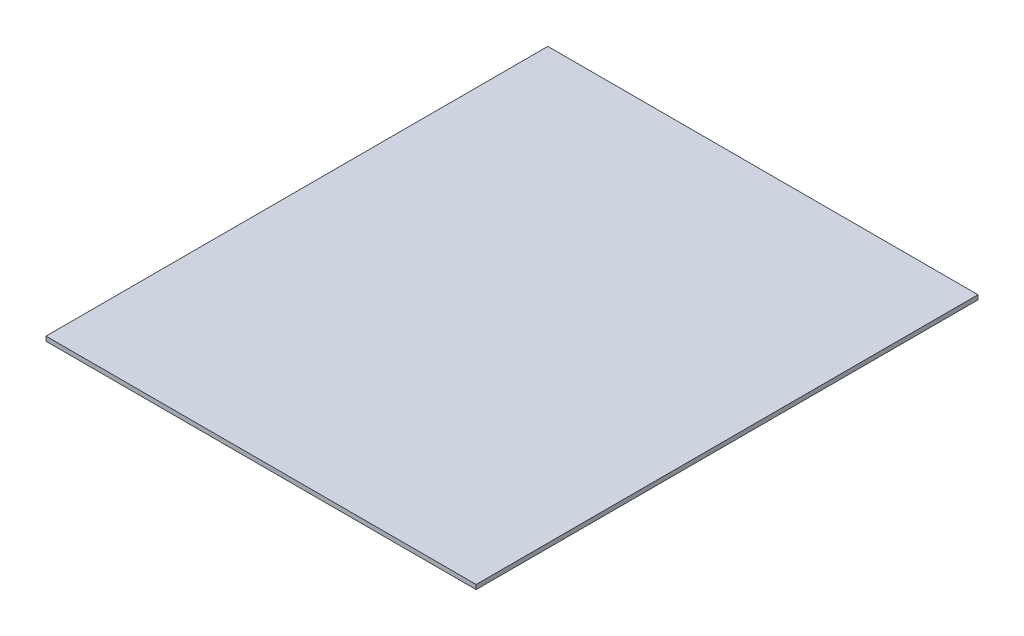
from build123d import *

# Parameters (mm, degrees)
SKETCH1_W           = 609.6
SKETCH1_H           = 711.2
BOSS_EXTRUDE1_DEPTH = 6.35


with BuildPart() as part:
    # Sketch1 → Boss-Extrude1 (new body)
    with BuildSketch(Plane(origin=(0, 0, 0), x_dir=(1, 0, 0), z_dir=(0, 1, 0))):
        Rectangle(SKETCH1_W, SKETCH1_H)
    extrude(amount=BOSS_EXTRUDE1_DEPTH)


solid = part.part
